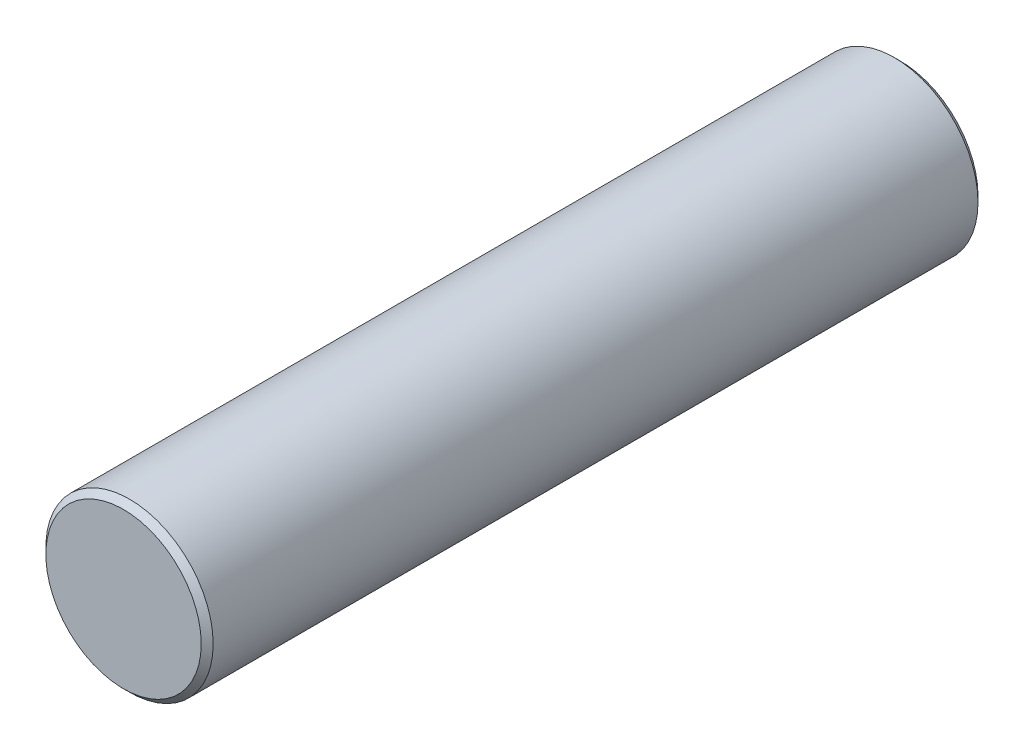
ISO-10303-21;
HEADER;
FILE_DESCRIPTION(('STEP AP214'),'2;1');
FILE_NAME('part.step','',(''),(''),'','','');
FILE_SCHEMA(('AUTOMOTIVE_DESIGN { 1 0 10303 214 1 1 1 1 }'));
ENDSEC;
DATA;
#1=APPLICATION_CONTEXT('core data for automotive mechanical design processes');
#2=APPLICATION_PROTOCOL_DEFINITION('international standard','automotive_design',2000,#1);
#3=PRODUCT_CONTEXT('',#1,'mechanical');
#4=PRODUCT('Part','Part','',(#3));
#5=PRODUCT_RELATED_PRODUCT_CATEGORY('part','',(#4));
#6=PRODUCT_DEFINITION_FORMATION('','',#4);
#7=PRODUCT_DEFINITION_CONTEXT('part definition',#1,'design');
#8=PRODUCT_DEFINITION('design','',#6,#7);
#9=PRODUCT_DEFINITION_SHAPE('','',#8);
#10=(LENGTH_UNIT() NAMED_UNIT(*) SI_UNIT(.MILLI.,.METRE.));
#11=(NAMED_UNIT(*) PLANE_ANGLE_UNIT() SI_UNIT($,.RADIAN.));
#12=(NAMED_UNIT(*) SI_UNIT($,.STERADIAN.) SOLID_ANGLE_UNIT());
#13=UNCERTAINTY_MEASURE_WITH_UNIT(LENGTH_MEASURE(1.E-05),#10,'distance_accuracy_value','');
#14=(GEOMETRIC_REPRESENTATION_CONTEXT(3) GLOBAL_UNCERTAINTY_ASSIGNED_CONTEXT((#13)) GLOBAL_UNIT_ASSIGNED_CONTEXT((#10,
#11,#12)) REPRESENTATION_CONTEXT('',''));
#15=CARTESIAN_POINT('',(0.,0.,0.));
#16=DIRECTION('',(0.,0.,1.));
#17=DIRECTION('',(1.,0.,0.));
#18=AXIS2_PLACEMENT_3D('',#15,#16,#17);
#19=CARTESIAN_POINT('',(0.,0.,32.5));
#20=DIRECTION('',(0.,0.,-1.));
#21=DIRECTION('',(-1.,0.,0.));
#22=AXIS2_PLACEMENT_3D('',#19,#20,#21);
#23=CYLINDRICAL_SURFACE('',#22,7.);
#24=CARTESIAN_POINT('',(0.,0.,-32.));
#25=DIRECTION('',(0.,0.,1.));
#26=DIRECTION('',(1.,0.,0.));
#27=AXIS2_PLACEMENT_3D('',#24,#25,#26);
#28=CIRCLE('',#27,7.);
#29=CARTESIAN_POINT('',(7.,0.,-32.));
#30=VERTEX_POINT('',#29);
#31=EDGE_CURVE('E42',#30,#30,#28,.T.);
#32=ORIENTED_EDGE('',*,*,#31,.T.);
#33=EDGE_LOOP('',(#32));
#34=FACE_BOUND('',#33,.T.);
#35=CARTESIAN_POINT('',(0.,0.,32.));
#36=DIRECTION('',(0.,0.,1.));
#37=DIRECTION('',(1.,0.,0.));
#38=AXIS2_PLACEMENT_3D('',#35,#36,#37);
#39=CIRCLE('',#38,7.);
#40=CARTESIAN_POINT('',(7.,0.,32.));
#41=VERTEX_POINT('',#40);
#42=EDGE_CURVE('E46',#41,#41,#39,.F.);
#43=ORIENTED_EDGE('',*,*,#42,.T.);
#44=EDGE_LOOP('',(#43));
#45=FACE_BOUND('',#44,.T.);
#46=ADVANCED_FACE('F31',(#34,#45),#23,.T.);
#47=CARTESIAN_POINT('',(0.,0.,32.5));
#48=DIRECTION('',(0.,0.,1.));
#49=DIRECTION('',(1.,0.,0.));
#50=AXIS2_PLACEMENT_3D('',#47,#48,#49);
#51=PLANE('',#50);
#52=CARTESIAN_POINT('',(0.,0.,32.5));
#53=DIRECTION('',(0.,0.,1.));
#54=DIRECTION('',(1.,0.,0.));
#55=AXIS2_PLACEMENT_3D('',#52,#53,#54);
#56=CIRCLE('',#55,6.49999999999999);
#57=CARTESIAN_POINT('',(6.49999999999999,0.,32.5));
#58=VERTEX_POINT('',#57);
#59=EDGE_CURVE('E10',#58,#58,#56,.T.);
#60=ORIENTED_EDGE('',*,*,#59,.T.);
#61=EDGE_LOOP('',(#60));
#62=FACE_BOUND('',#61,.T.);
#63=ADVANCED_FACE('F62',(#62),#51,.T.);
#64=CARTESIAN_POINT('',(0.,0.,-32.5));
#65=DIRECTION('',(0.,0.,1.));
#66=DIRECTION('',(1.,0.,0.));
#67=AXIS2_PLACEMENT_3D('',#64,#65,#66);
#68=PLANE('',#67);
#69=CARTESIAN_POINT('',(0.,0.,-32.5));
#70=DIRECTION('',(0.,0.,1.));
#71=DIRECTION('',(1.,0.,0.));
#72=AXIS2_PLACEMENT_3D('',#69,#70,#71);
#73=CIRCLE('',#72,6.50000000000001);
#74=CARTESIAN_POINT('',(6.50000000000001,0.,-32.5));
#75=VERTEX_POINT('',#74);
#76=EDGE_CURVE('E38',#75,#75,#73,.F.);
#77=ORIENTED_EDGE('',*,*,#76,.T.);
#78=EDGE_LOOP('',(#77));
#79=FACE_BOUND('',#78,.T.);
#80=ADVANCED_FACE('F59',(#79),#68,.F.);
#81=CARTESIAN_POINT('',(0.,0.,-32.));
#82=DIRECTION('',(0.,0.,1.));
#83=DIRECTION('',(1.,0.,0.));
#84=AXIS2_PLACEMENT_3D('',#81,#82,#83);
#85=CONICAL_SURFACE('',#84,7.,0.785398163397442);
#86=ORIENTED_EDGE('',*,*,#76,.F.);
#87=EDGE_LOOP('',(#86));
#88=FACE_BOUND('',#87,.T.);
#89=ORIENTED_EDGE('',*,*,#31,.F.);
#90=EDGE_LOOP('',(#89));
#91=FACE_BOUND('',#90,.T.);
#92=ADVANCED_FACE('F55',(#88,#91),#85,.T.);
#93=CARTESIAN_POINT('',(0.,0.,32.5));
#94=DIRECTION('',(0.,0.,-1.));
#95=DIRECTION('',(-1.,0.,0.));
#96=AXIS2_PLACEMENT_3D('',#93,#94,#95);
#97=CONICAL_SURFACE('',#96,6.49999999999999,0.785398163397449);
#98=ORIENTED_EDGE('',*,*,#42,.F.);
#99=EDGE_LOOP('',(#98));
#100=FACE_BOUND('',#99,.T.);
#101=ORIENTED_EDGE('',*,*,#59,.F.);
#102=EDGE_LOOP('',(#101));
#103=FACE_BOUND('',#102,.T.);
#104=ADVANCED_FACE('F33',(#100,#103),#97,.T.);
#105=CLOSED_SHELL('',(#46,#63,#80,#92,#104));
#106=MANIFOLD_SOLID_BREP('B2',#105);
#107=ADVANCED_BREP_SHAPE_REPRESENTATION('',(#18,#106),#14);
#108=SHAPE_DEFINITION_REPRESENTATION(#9,#107);
ENDSEC;
END-ISO-10303-21;
